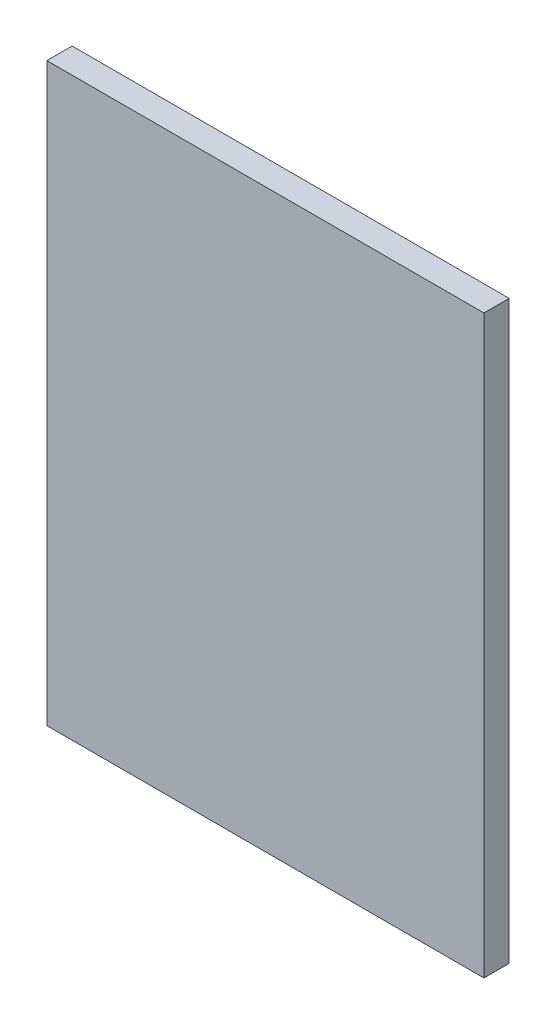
from build123d import *

# Parameters (mm, degrees)
SKETCH_1_W      = 277
SKETCH_1_H      = 365
EXTRUDE_1_DEPTH = 16


with BuildPart() as part:
    # Sketch 1 → Extrude 1 (new body)
    with BuildSketch(Plane.XY):
        with Locations((138.5, -182.5)):
            Rectangle(SKETCH_1_W, SKETCH_1_H)
    extrude(amount=EXTRUDE_1_DEPTH)


solid = part.part
